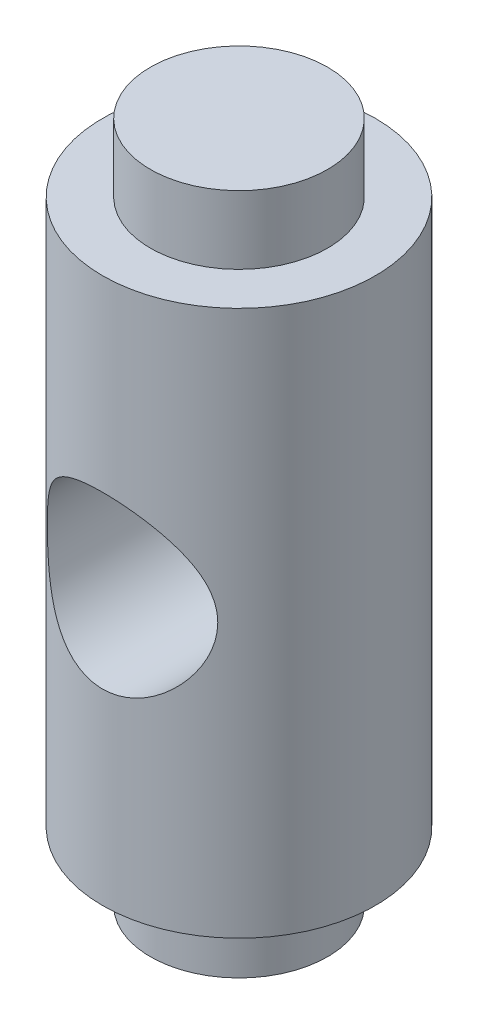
ISO-10303-21;
HEADER;
FILE_DESCRIPTION(('STEP AP214'),'2;1');
FILE_NAME('part.step','',(''),(''),'','','');
FILE_SCHEMA(('AUTOMOTIVE_DESIGN { 1 0 10303 214 1 1 1 1 }'));
ENDSEC;
DATA;
#1=APPLICATION_CONTEXT('core data for automotive mechanical design processes');
#2=APPLICATION_PROTOCOL_DEFINITION('international standard','automotive_design',2000,#1);
#3=PRODUCT_CONTEXT('',#1,'mechanical');
#4=PRODUCT('Part','Part','',(#3));
#5=PRODUCT_RELATED_PRODUCT_CATEGORY('part','',(#4));
#6=PRODUCT_DEFINITION_FORMATION('','',#4);
#7=PRODUCT_DEFINITION_CONTEXT('part definition',#1,'design');
#8=PRODUCT_DEFINITION('design','',#6,#7);
#9=PRODUCT_DEFINITION_SHAPE('','',#8);
#10=(LENGTH_UNIT() NAMED_UNIT(*) SI_UNIT(.MILLI.,.METRE.));
#11=(NAMED_UNIT(*) PLANE_ANGLE_UNIT() SI_UNIT($,.RADIAN.));
#12=(NAMED_UNIT(*) SI_UNIT($,.STERADIAN.) SOLID_ANGLE_UNIT());
#13=UNCERTAINTY_MEASURE_WITH_UNIT(LENGTH_MEASURE(1.E-05),#10,'distance_accuracy_value','');
#14=(GEOMETRIC_REPRESENTATION_CONTEXT(3) GLOBAL_UNCERTAINTY_ASSIGNED_CONTEXT((#13)) GLOBAL_UNIT_ASSIGNED_CONTEXT((#10,
#11,#12)) REPRESENTATION_CONTEXT('',''));
#15=CARTESIAN_POINT('',(0.,0.,0.));
#16=DIRECTION('',(0.,0.,1.));
#17=DIRECTION('',(1.,0.,0.));
#18=AXIS2_PLACEMENT_3D('',#15,#16,#17);
#19=CARTESIAN_POINT('',(-6.5,-25.,0.));
#20=DIRECTION('',(0.,1.,0.));
#21=DIRECTION('',(0.,0.,1.));
#22=AXIS2_PLACEMENT_3D('',#19,#20,#21);
#23=PLANE('',#22);
#24=CARTESIAN_POINT('',(0.,-25.,0.));
#25=DIRECTION('',(0.,-1.,0.));
#26=DIRECTION('',(0.,0.,-1.));
#27=AXIS2_PLACEMENT_3D('',#24,#25,#26);
#28=CIRCLE('',#27,6.5);
#29=CARTESIAN_POINT('',(0.,-25.,-6.5));
#30=VERTEX_POINT('',#29);
#31=EDGE_CURVE('E111',#30,#30,#28,.T.);
#32=ORIENTED_EDGE('',*,*,#31,.T.);
#33=EDGE_LOOP('',(#32));
#34=FACE_BOUND('',#33,.T.);
#35=ADVANCED_FACE('F53',(#34),#23,.F.);
#36=CARTESIAN_POINT('',(0.,25.,0.));
#37=DIRECTION('',(0.,-1.,0.));
#38=DIRECTION('',(0.,0.,-1.));
#39=AXIS2_PLACEMENT_3D('',#36,#37,#38);
#40=PLANE('',#39);
#41=CARTESIAN_POINT('',(0.,25.,0.));
#42=DIRECTION('',(0.,-1.,0.));
#43=DIRECTION('',(0.,0.,-1.));
#44=AXIS2_PLACEMENT_3D('',#41,#42,#43);
#45=CIRCLE('',#44,6.50000000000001);
#46=CARTESIAN_POINT('',(0.,25.,-6.50000000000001));
#47=VERTEX_POINT('',#46);
#48=EDGE_CURVE('E12',#47,#47,#45,.T.);
#49=ORIENTED_EDGE('',*,*,#48,.F.);
#50=EDGE_LOOP('',(#49));
#51=FACE_BOUND('',#50,.T.);
#52=ADVANCED_FACE('F102',(#51),#40,.F.);
#53=CARTESIAN_POINT('',(0.,-25.,0.));
#54=DIRECTION('',(0.,-1.,0.));
#55=DIRECTION('',(0.,0.,-1.));
#56=AXIS2_PLACEMENT_3D('',#53,#54,#55);
#57=CYLINDRICAL_SURFACE('',#56,6.50000000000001);
#58=CARTESIAN_POINT('',(0.,20.,0.));
#59=DIRECTION('',(0.,-1.,0.));
#60=DIRECTION('',(0.,0.,-1.));
#61=AXIS2_PLACEMENT_3D('',#58,#59,#60);
#62=CIRCLE('',#61,6.50000000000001);
#63=CARTESIAN_POINT('',(0.,20.,-6.50000000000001));
#64=VERTEX_POINT('',#63);
#65=EDGE_CURVE('E65',#64,#64,#62,.T.);
#66=ORIENTED_EDGE('',*,*,#65,.F.);
#67=EDGE_LOOP('',(#66));
#68=FACE_BOUND('',#67,.T.);
#69=ORIENTED_EDGE('',*,*,#48,.T.);
#70=EDGE_LOOP('',(#69));
#71=FACE_BOUND('',#70,.T.);
#72=ADVANCED_FACE('F107',(#68,#71),#57,.T.);
#73=CARTESIAN_POINT('',(-6.50000000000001,20.,0.));
#74=DIRECTION('',(0.,-1.,0.));
#75=DIRECTION('',(0.,0.,-1.));
#76=AXIS2_PLACEMENT_3D('',#73,#74,#75);
#77=PLANE('',#76);
#78=CARTESIAN_POINT('',(0.,20.,0.));
#79=DIRECTION('',(0.,-1.,0.));
#80=DIRECTION('',(0.,0.,-1.));
#81=AXIS2_PLACEMENT_3D('',#78,#79,#80);
#82=CIRCLE('',#81,10.);
#83=CARTESIAN_POINT('',(0.,20.,-10.));
#84=VERTEX_POINT('',#83);
#85=EDGE_CURVE('E70',#84,#84,#82,.T.);
#86=ORIENTED_EDGE('',*,*,#85,.F.);
#87=EDGE_LOOP('',(#86));
#88=FACE_BOUND('',#87,.T.);
#89=ORIENTED_EDGE('',*,*,#65,.T.);
#90=EDGE_LOOP('',(#89));
#91=FACE_BOUND('',#90,.T.);
#92=ADVANCED_FACE('F97',(#88,#91),#77,.F.);
#93=CARTESIAN_POINT('',(0.,-25.,0.));
#94=DIRECTION('',(0.,-1.,0.));
#95=DIRECTION('',(0.,0.,-1.));
#96=AXIS2_PLACEMENT_3D('',#93,#94,#95);
#97=CYLINDRICAL_SURFACE('',#96,10.);
#98=CARTESIAN_POINT('',(0.,6.24999999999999,-10.));
#99=CARTESIAN_POINT('',(-0.158849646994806,6.24999962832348,-9.99999962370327));
#100=CARTESIAN_POINT('',(-0.317707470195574,6.24393596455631,-9.99620658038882));
#101=CARTESIAN_POINT('',(-0.634207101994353,6.21976567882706,-9.98112704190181));
#102=CARTESIAN_POINT('',(-0.791848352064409,6.20165382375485,-9.96983729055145));
#103=CARTESIAN_POINT('',(-1.10484904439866,6.15360979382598,-9.94002305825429));
#104=CARTESIAN_POINT('',(-1.26020495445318,6.12366098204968,-9.92148839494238));
#105=CARTESIAN_POINT('',(-1.5673500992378,6.05233722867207,-9.87762604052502));
#106=CARTESIAN_POINT('',(-1.71913779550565,6.01095745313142,-9.8522954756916));
#107=CARTESIAN_POINT('',(-2.01729599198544,5.91754049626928,-9.79558133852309));
#108=CARTESIAN_POINT('',(-2.16369143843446,5.86556242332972,-9.76423139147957));
#109=CARTESIAN_POINT('',(-2.45114568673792,5.75137686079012,-9.69606866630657));
#110=CARTESIAN_POINT('',(-2.5922023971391,5.68916541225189,-9.6592537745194));
#111=CARTESIAN_POINT('',(-3.00613981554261,5.48812936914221,-9.54175890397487));
#112=CARTESIAN_POINT('',(-3.27012271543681,5.33479662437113,-9.45396244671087));
#113=CARTESIAN_POINT('',(-3.78991309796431,4.98055654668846,-9.25850339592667));
#114=CARTESIAN_POINT('',(-4.04338414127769,4.77682781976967,-9.14981422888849));
#115=CARTESIAN_POINT('',(-4.51494555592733,4.33387977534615,-8.92655135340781));
#116=CARTESIAN_POINT('',(-4.73298754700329,4.09461276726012,-8.81196987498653));
#117=CARTESIAN_POINT('',(-5.04439177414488,3.69463425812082,-8.63545017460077));
#118=CARTESIAN_POINT('',(-5.15093581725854,3.54461555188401,-8.57214497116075));
#119=CARTESIAN_POINT('',(-5.35092242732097,3.2348367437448,-8.44875316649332));
#120=CARTESIAN_POINT('',(-5.44436254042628,3.075074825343,-8.38866716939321));
#121=CARTESIAN_POINT('',(-5.70358441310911,2.58241975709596,-8.21657024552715));
#122=CARTESIAN_POINT('',(-5.84888618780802,2.23536799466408,-8.11235199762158));
#123=CARTESIAN_POINT('',(-6.04669029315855,1.60585511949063,-7.96547270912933));
#124=CARTESIAN_POINT('',(-6.11348568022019,1.3299784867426,-7.91385726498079));
#125=CARTESIAN_POINT('',(-6.18522365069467,0.908757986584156,-7.85772563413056));
#126=CARTESIAN_POINT('',(-6.20439258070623,0.767152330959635,-7.84256478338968));
#127=CARTESIAN_POINT('',(-6.23300288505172,0.482325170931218,-7.81984863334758));
#128=CARTESIAN_POINT('',(-6.24244412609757,0.339103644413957,-7.81229343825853));
#129=CARTESIAN_POINT('',(-6.25144296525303,0.0517742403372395,-7.80509383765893));
#130=CARTESIAN_POINT('',(-6.25097436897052,-0.092334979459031,-7.80547039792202));
#131=CARTESIAN_POINT('',(-6.2401009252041,-0.379934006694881,-7.81416589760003));
#132=CARTESIAN_POINT('',(-6.22969602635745,-0.523423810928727,-7.82248487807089));
#133=CARTESIAN_POINT('',(-6.19911092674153,-0.808776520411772,-7.84674476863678));
#134=CARTESIAN_POINT('',(-6.17892587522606,-0.950638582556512,-7.86268946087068));
#135=CARTESIAN_POINT('',(-6.12909005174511,-1.2317325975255,-7.90159751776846));
#136=CARTESIAN_POINT('',(-6.0994353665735,-1.37096343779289,-7.92456378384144));
#137=CARTESIAN_POINT('',(-5.99842622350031,-1.77702636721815,-8.00162469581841));
#138=CARTESIAN_POINT('',(-5.91425257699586,-2.03912297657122,-8.06453672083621));
#139=CARTESIAN_POINT('',(-5.71450774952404,-2.54584522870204,-8.20727735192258));
#140=CARTESIAN_POINT('',(-5.59892546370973,-2.79046465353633,-8.28711193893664));
#141=CARTESIAN_POINT('',(-5.31472790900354,-3.304176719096,-8.47275009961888));
#142=CARTESIAN_POINT('',(-5.14023916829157,-3.56930469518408,-8.58061888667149));
#143=CARTESIAN_POINT('',(-4.85091898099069,-3.94411817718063,-8.74534116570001));
#144=CARTESIAN_POINT('',(-4.7497903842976,-4.06532948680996,-8.80077999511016));
#145=CARTESIAN_POINT('',(-4.53858166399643,-4.29984502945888,-8.91153619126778));
#146=CARTESIAN_POINT('',(-4.42849989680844,-4.41314780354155,-8.96685353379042));
#147=CARTESIAN_POINT('',(-4.1808127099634,-4.64943582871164,-9.08529805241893));
#148=CARTESIAN_POINT('',(-4.04166674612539,-4.77092184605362,-9.14820324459));
#149=CARTESIAN_POINT('',(-3.75230201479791,-5.00169555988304,-9.27064717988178));
#150=CARTESIAN_POINT('',(-3.60208734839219,-5.11098773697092,-9.3301871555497));
#151=CARTESIAN_POINT('',(-3.2911853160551,-5.31651397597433,-9.44433792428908));
#152=CARTESIAN_POINT('',(-3.13049780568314,-5.41274785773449,-9.49894864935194));
#153=CARTESIAN_POINT('',(-2.79950918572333,-5.59111587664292,-9.60170623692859));
#154=CARTESIAN_POINT('',(-2.62920921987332,-5.67325168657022,-9.64985386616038));
#155=CARTESIAN_POINT('',(-2.28952714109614,-5.81831642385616,-9.73586579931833));
#156=CARTESIAN_POINT('',(-2.12059117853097,-5.88204249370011,-9.77414474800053));
#157=CARTESIAN_POINT('',(-1.77631615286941,-5.99499894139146,-9.84253471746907));
#158=CARTESIAN_POINT('',(-1.60097720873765,-6.04422958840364,-9.87264588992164));
#159=CARTESIAN_POINT('',(-1.24560560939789,-6.12733425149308,-9.92374181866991));
#160=CARTESIAN_POINT('',(-1.06557873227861,-6.16122630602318,-9.94473729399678));
#161=CARTESIAN_POINT('',(-0.702394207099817,-6.21311293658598,-9.97696623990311));
#162=CARTESIAN_POINT('',(-0.519237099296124,-6.23111022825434,-9.98820137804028));
#163=CARTESIAN_POINT('',(-0.179048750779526,-6.24940014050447,-9.99962329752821));
#164=CARTESIAN_POINT('',(-0.022179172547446,-6.25192604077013,-10.0012036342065));
#165=CARTESIAN_POINT('',(0.291205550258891,-6.24517861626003,-9.99698690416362));
#166=CARTESIAN_POINT('',(0.447720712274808,-6.23590588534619,-9.99119020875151));
#167=CARTESIAN_POINT('',(0.75915979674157,-6.2056952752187,-9.97236256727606));
#168=CARTESIAN_POINT('',(0.914083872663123,-6.18475853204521,-9.95933232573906));
#169=CARTESIAN_POINT('',(1.22121210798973,-6.13151164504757,-9.92635375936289));
#170=CARTESIAN_POINT('',(1.37341621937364,-6.09920130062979,-9.906405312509));
#171=CARTESIAN_POINT('',(1.66813711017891,-6.02511273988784,-9.86096653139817));
#172=CARTESIAN_POINT('',(1.81079921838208,-5.98375811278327,-9.835725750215));
#173=CARTESIAN_POINT('',(2.09188090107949,-5.89138769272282,-9.77980605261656));
#174=CARTESIAN_POINT('',(2.23029910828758,-5.84036882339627,-9.7491254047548));
#175=CARTESIAN_POINT('',(2.63804910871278,-5.67356171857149,-9.64980584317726));
#176=CARTESIAN_POINT('',(2.90010027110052,-5.54396581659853,-9.57385340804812));
#177=CARTESIAN_POINT('',(3.42545821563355,-5.23741629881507,-9.39949765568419));
#178=CARTESIAN_POINT('',(3.68622176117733,-5.05700284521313,-9.2996020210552));
#179=CARTESIAN_POINT('',(4.1757262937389,-4.66100995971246,-9.09033470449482));
#180=CARTESIAN_POINT('',(4.40443117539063,-4.44539146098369,-8.98095255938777));
#181=CARTESIAN_POINT('',(4.73648810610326,-4.08171051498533,-8.80819673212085));
#182=CARTESIAN_POINT('',(4.85166707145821,-3.94411382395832,-8.74512043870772));
#183=CARTESIAN_POINT('',(5.07005690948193,-3.65913503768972,-8.62034509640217));
#184=CARTESIAN_POINT('',(5.17326566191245,-3.51175121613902,-8.55864629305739));
#185=CARTESIAN_POINT('',(5.46389678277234,-3.05582609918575,-8.37840046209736));
#186=CARTESIAN_POINT('',(5.6327187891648,-2.73307989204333,-8.2644890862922));
#187=CARTESIAN_POINT('',(5.88426784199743,-2.12644842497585,-8.08666353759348));
#188=CARTESIAN_POINT('',(5.97762402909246,-1.84859906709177,-8.0172742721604));
#189=CARTESIAN_POINT('',(6.08820969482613,-1.42054627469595,-7.9332084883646));
#190=CARTESIAN_POINT('',(6.12015992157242,-1.27601322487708,-7.90852594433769));
#191=CARTESIAN_POINT('',(6.17383335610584,-0.984015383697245,-7.86669922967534));
#192=CARTESIAN_POINT('',(6.19556096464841,-0.836551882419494,-7.849551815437));
#193=CARTESIAN_POINT('',(6.22854173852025,-0.538829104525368,-7.82340808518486));
#194=CARTESIAN_POINT('',(6.2397310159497,-0.388558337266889,-7.81446149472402));
#195=CARTESIAN_POINT('',(6.25120688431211,-0.0873306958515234,-7.80528467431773));
#196=CARTESIAN_POINT('',(6.25149352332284,0.0636261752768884,-7.80505440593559));
#197=CARTESIAN_POINT('',(6.24115662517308,0.364967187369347,-7.81332234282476));
#198=CARTESIAN_POINT('',(6.23052977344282,0.515351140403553,-7.82182319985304));
#199=CARTESIAN_POINT('',(6.19855546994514,0.814250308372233,-7.84718570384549));
#200=CARTESIAN_POINT('',(6.17720816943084,0.96276554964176,-7.86404723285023));
#201=CARTESIAN_POINT('',(6.12629668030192,1.24492872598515,-7.90376101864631));
#202=CARTESIAN_POINT('',(6.09753696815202,1.3788074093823,-7.92601825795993));
#203=CARTESIAN_POINT('',(6.03161425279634,1.64339223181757,-7.97629888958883));
#204=CARTESIAN_POINT('',(5.99444845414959,1.77409729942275,-8.00432419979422));
#205=CARTESIAN_POINT('',(5.87091068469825,2.1605506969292,-8.09585891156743));
#206=CARTESIAN_POINT('',(5.77247378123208,2.41077058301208,-8.16684719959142));
#207=CARTESIAN_POINT('',(5.53013092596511,2.92801764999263,-8.33319831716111));
#208=CARTESIAN_POINT('',(5.3817054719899,3.19223374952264,-8.43060205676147));
#209=CARTESIAN_POINT('',(5.04997758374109,3.69470959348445,-8.63339479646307));
#210=CARTESIAN_POINT('',(4.86664695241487,3.93294810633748,-8.73879021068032));
#211=CARTESIAN_POINT('',(4.54776743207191,4.29099246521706,-8.90708368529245));
#212=CARTESIAN_POINT('',(4.42247185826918,4.420029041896,-8.97010341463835));
#213=CARTESIAN_POINT('',(4.1607895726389,4.66719403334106,-9.09443707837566));
#214=CARTESIAN_POINT('',(4.02440616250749,4.78532567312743,-9.15575151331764));
#215=CARTESIAN_POINT('',(3.74093187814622,5.01005717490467,-9.27518783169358));
#216=CARTESIAN_POINT('',(3.5938322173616,5.11664739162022,-9.33330702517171));
#217=CARTESIAN_POINT('',(3.28961408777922,5.31734354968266,-9.44482299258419));
#218=CARTESIAN_POINT('',(3.13249462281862,5.41144824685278,-9.49821929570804));
#219=CARTESIAN_POINT('',(2.80869746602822,5.58638047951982,-9.59895946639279));
#220=CARTESIAN_POINT('',(2.64200029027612,5.66717955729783,-9.64629031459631));
#221=CARTESIAN_POINT('',(2.30048838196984,5.81418820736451,-9.73338475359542));
#222=CARTESIAN_POINT('',(2.12567840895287,5.88040620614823,-9.77315271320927));
#223=CARTESIAN_POINT('',(1.76968730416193,5.99714094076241,-9.84383294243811));
#224=CARTESIAN_POINT('',(1.58852482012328,6.04769994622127,-9.8747690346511));
#225=CARTESIAN_POINT('',(1.22114051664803,6.13243883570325,-9.92689202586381));
#226=CARTESIAN_POINT('',(1.03492253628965,6.16663080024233,-9.94808611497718));
#227=CARTESIAN_POINT('',(0.707135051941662,6.21147686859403,-9.97595756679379));
#228=CARTESIAN_POINT('',(0.566265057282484,6.22590687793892,-9.98495677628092));
#229=CARTESIAN_POINT('',(0.283598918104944,6.24516890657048,-9.99697834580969));
#230=CARTESIAN_POINT('',(0.14180271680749,6.25000033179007,-10.0000003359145));
#231=CARTESIAN_POINT('',(0.,6.24999999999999,-10.));
#232=B_SPLINE_CURVE_WITH_KNOTS('',3,(#98,#99,#100,#101,#102,#103,#104,#105,#106,#107,#108,#109,
#110,#111,#112,#113,#114,#115,#116,#117,#118,#119,#120,#121,#122,#123,#124,#125,#126,#127,#128,
#129,#130,#131,#132,#133,#134,#135,#136,#137,#138,#139,#140,#141,#142,#143,#144,#145,#146,#147,
#148,#149,#150,#151,#152,#153,#154,#155,#156,#157,#158,#159,#160,#161,#162,#163,#164,#165,#166,
#167,#168,#169,#170,#171,#172,#173,#174,#175,#176,#177,#178,#179,#180,#181,#182,#183,#184,#185,
#186,#187,#188,#189,#190,#191,#192,#193,#194,#195,#196,#197,#198,#199,#200,#201,#202,#203,#204,
#205,#206,#207,#208,#209,#210,#211,#212,#213,#214,#215,#216,#217,#218,#219,#220,#221,#222,#223,
#224,#225,#226,#227,#228,#229,#230,#231),.UNSPECIFIED.,.T.,.F.,(4,2,2,2,2,2,2,2,2,2,2,2,2,2,2,2,
2,2,2,2,2,2,2,2,2,2,2,2,2,2,2,2,2,2,2,2,2,2,2,2,2,2,2,2,2,2,2,2,2,2,2,2,2,2,2,2,2,2,2,2,2,2,2,2,
2,2,4),(0.,0.476403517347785,0.953014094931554,1.43029694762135,1.90778194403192,
2.3826733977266,2.85774900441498,3.80683933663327,4.8317234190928,5.85799548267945,
6.44111179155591,7.02433714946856,8.18762458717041,9.04928880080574,9.47991092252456,
9.91053894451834,10.3423053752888,10.7740740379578,11.2060570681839,11.6382188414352,
12.4818815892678,13.3258430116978,14.3274621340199,14.8290636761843,15.3307575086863,
15.9154508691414,16.4999286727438,17.0844145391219,17.6688310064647,18.2217184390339,
18.7745956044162,19.3268208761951,19.8789517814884,20.3490458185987,20.8191161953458,
21.2891407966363,21.7591736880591,22.210671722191,22.6623137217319,23.5649034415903,
24.5586000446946,25.5534069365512,26.1234425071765,26.6935788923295,27.8320048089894,
28.7317904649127,29.1814976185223,29.6310109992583,30.083232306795,30.535451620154,
30.9878083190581,31.4401586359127,31.8559131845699,32.2718061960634,33.1031851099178,
34.0549238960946,35.0074348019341,35.5786225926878,36.1496409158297,36.7211328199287,
37.2926816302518,37.8654374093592,38.4378613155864,39.0087262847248,39.5791692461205,
40.0044212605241,40.4296995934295),.UNSPECIFIED.);
#233=CARTESIAN_POINT('',(0.,6.24999999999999,-10.));
#234=VERTEX_POINT('',#233);
#235=EDGE_CURVE('E56',#234,#234,#232,.T.);
#236=ORIENTED_EDGE('',*,*,#235,.T.);
#237=EDGE_LOOP('',(#236));
#238=FACE_BOUND('',#237,.T.);
#239=CARTESIAN_POINT('',(6.24999999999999,0.,7.80624749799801));
#240=CARTESIAN_POINT('',(6.249998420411,-0.155387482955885,7.80624999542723));
#241=CARTESIAN_POINT('',(6.24419345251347,-0.31080490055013,7.81090743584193));
#242=CARTESIAN_POINT('',(6.22107983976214,-0.620302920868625,7.82932791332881));
#243=CARTESIAN_POINT('',(6.20376441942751,-0.774382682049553,7.84309631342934));
#244=CARTESIAN_POINT('',(6.15789601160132,-1.08016617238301,7.87916024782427));
#245=CARTESIAN_POINT('',(6.12932035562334,-1.23186446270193,7.90147298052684));
#246=CARTESIAN_POINT('',(6.06140113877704,-1.53152285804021,7.95369366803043));
#247=CARTESIAN_POINT('',(6.02205219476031,-1.67948105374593,7.98360541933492));
#248=CARTESIAN_POINT('',(5.88944383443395,-2.11373015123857,8.08248455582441));
#249=CARTESIAN_POINT('',(5.78115473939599,-2.39341060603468,8.16098921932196));
#250=CARTESIAN_POINT('',(5.52859220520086,-2.93008674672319,8.33415018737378));
#251=CARTESIAN_POINT('',(5.3843177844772,-3.18708181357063,8.42880693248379));
#252=CARTESIAN_POINT('',(5.04117438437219,-3.70933905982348,8.63899089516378));
#253=CARTESIAN_POINT('',(4.83757785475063,-3.97108500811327,8.75561439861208));
#254=CARTESIAN_POINT('',(4.50310779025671,-4.33727102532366,8.92960975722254));
#255=CARTESIAN_POINT('',(4.38667459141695,-4.45500513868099,8.9874941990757));
#256=CARTESIAN_POINT('',(4.14437550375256,-4.68125143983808,9.1017618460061));
#257=CARTESIAN_POINT('',(4.01850779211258,-4.78976183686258,9.1581447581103));
#258=CARTESIAN_POINT('',(3.74198038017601,-5.0094846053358,9.27484517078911));
#259=CARTESIAN_POINT('',(3.59016440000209,-5.11943222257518,9.33481202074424));
#260=CARTESIAN_POINT('',(3.27596963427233,-5.32595927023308,9.44965505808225));
#261=CARTESIAN_POINT('',(3.11359567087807,-5.42254474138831,9.50453354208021));
#262=CARTESIAN_POINT('',(2.77917438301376,-5.60130490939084,9.6076421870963));
#263=CARTESIAN_POINT('',(2.60713168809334,-5.68348642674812,9.65587549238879));
#264=CARTESIAN_POINT('',(2.25447682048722,-5.83236190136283,9.74424725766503));
#265=CARTESIAN_POINT('',(2.07386621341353,-5.89905867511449,9.78438718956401));
#266=CARTESIAN_POINT('',(1.72429670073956,-6.00994391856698,9.85165924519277));
#267=CARTESIAN_POINT('',(1.55601899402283,-6.05573098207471,9.87969874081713));
#268=CARTESIAN_POINT('',(1.21508140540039,-6.13323954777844,9.92739601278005));
#269=CARTESIAN_POINT('',(1.04242179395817,-6.16496191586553,9.94705430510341));
#270=CARTESIAN_POINT('',(0.694418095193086,-6.21378548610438,9.97738765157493));
#271=CARTESIAN_POINT('',(0.519076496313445,-6.23089949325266,9.98807057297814));
#272=CARTESIAN_POINT('',(0.167262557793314,-6.25024383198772,10.0001494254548));
#273=CARTESIAN_POINT('',(-0.0092096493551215,-6.25247587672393,10.0015464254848));
#274=CARTESIAN_POINT('',(-0.337797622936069,-6.24272897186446,9.99545690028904));
#275=CARTESIAN_POINT('',(-0.489995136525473,-6.2326220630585,9.98914058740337));
#276=CARTESIAN_POINT('',(-0.792864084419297,-6.20137456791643,9.96967381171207));
#277=CARTESIAN_POINT('',(-0.943535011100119,-6.18023042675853,9.95652114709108));
#278=CARTESIAN_POINT('',(-1.24218605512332,-6.12719105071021,9.92368567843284));
#279=CARTESIAN_POINT('',(-1.39016709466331,-6.09529957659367,9.9040051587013));
#280=CARTESIAN_POINT('',(-1.68259878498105,-6.02114007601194,9.85853794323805));
#281=CARTESIAN_POINT('',(-1.82704804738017,-5.97886803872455,9.8327488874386));
#282=CARTESIAN_POINT('',(-2.11183488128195,-5.88431877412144,9.77554531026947));
#283=CARTESIAN_POINT('',(-2.25216317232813,-5.83202070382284,9.74411907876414));
#284=CARTESIAN_POINT('',(-2.52771418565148,-5.71799109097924,9.67630245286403));
#285=CARTESIAN_POINT('',(-2.66293507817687,-5.6562562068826,9.63991030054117));
#286=CARTESIAN_POINT('',(-3.05995814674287,-5.45771071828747,9.52430903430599));
#287=CARTESIAN_POINT('',(-3.31332080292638,-5.30749199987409,9.43863344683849));
#288=CARTESIAN_POINT('',(-3.82360467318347,-4.95484984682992,9.24465724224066));
#289=CARTESIAN_POINT('',(-4.0770449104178,-4.7482561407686,9.13486787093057));
#290=CARTESIAN_POINT('',(-4.5480098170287,-4.29930878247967,8.90975545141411));
#291=CARTESIAN_POINT('',(-4.76548130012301,-4.05690316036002,8.79442452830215));
#292=CARTESIAN_POINT('',(-5.07500078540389,-3.65249695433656,8.61748442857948));
#293=CARTESIAN_POINT('',(-5.18050584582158,-3.50128924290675,8.55429402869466));
#294=CARTESIAN_POINT('',(-5.37833747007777,-3.18906409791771,8.43131246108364));
#295=CARTESIAN_POINT('',(-5.47066155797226,-3.02804482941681,8.37152193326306));
#296=CARTESIAN_POINT('',(-5.64116538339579,-2.69710163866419,8.25758814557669));
#297=CARTESIAN_POINT('',(-5.71936611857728,-2.52719142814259,8.2034365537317));
#298=CARTESIAN_POINT('',(-5.86084129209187,-2.17905934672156,8.10296698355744));
#299=CARTESIAN_POINT('',(-5.92412210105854,-2.00084106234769,8.05664566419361));
#300=CARTESIAN_POINT('',(-6.02017773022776,-1.68510420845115,7.98498866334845));
#301=CARTESIAN_POINT('',(-6.05659845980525,-1.54921061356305,7.95733787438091));
#302=CARTESIAN_POINT('',(-6.12036221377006,-1.27419668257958,7.908399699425));
#303=CARTESIAN_POINT('',(-6.14770743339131,-1.13507713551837,7.88711077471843));
#304=CARTESIAN_POINT('',(-6.19292945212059,-0.854566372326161,7.85165287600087));
#305=CARTESIAN_POINT('',(-6.21081692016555,-0.713177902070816,7.83747588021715));
#306=CARTESIAN_POINT('',(-6.23689599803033,-0.42894429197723,7.81673898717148));
#307=CARTESIAN_POINT('',(-6.24508745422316,-0.286099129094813,7.81017921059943));
#308=CARTESIAN_POINT('',(-6.25164471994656,0.000293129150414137,7.80493157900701));
#309=CARTESIAN_POINT('',(-6.24998784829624,0.143841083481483,7.8062618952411));
#310=CARTESIAN_POINT('',(-6.23682473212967,0.430189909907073,7.81678235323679));
#311=CARTESIAN_POINT('',(-6.22531843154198,0.572990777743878,7.82597253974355));
#312=CARTESIAN_POINT('',(-6.19263271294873,0.856865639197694,7.8518617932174));
#313=CARTESIAN_POINT('',(-6.17144828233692,0.997938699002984,7.86856475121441));
#314=CARTESIAN_POINT('',(-6.11972444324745,1.27737953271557,7.90885813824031));
#315=CARTESIAN_POINT('',(-6.0891811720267,1.41574616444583,7.93245141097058));
#316=CARTESIAN_POINT('',(-5.98526939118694,1.82092780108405,8.011497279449));
#317=CARTESIAN_POINT('',(-5.89901607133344,2.08285458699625,8.07572442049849));
#318=CARTESIAN_POINT('',(-5.69512055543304,2.58897546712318,8.22077814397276));
#319=CARTESIAN_POINT('',(-5.5774672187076,2.83316322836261,8.3016106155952));
#320=CARTESIAN_POINT('',(-5.2882516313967,3.3465409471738,8.48936955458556));
#321=CARTESIAN_POINT('',(-5.11069041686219,3.61163977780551,8.59833402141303));
#322=CARTESIAN_POINT('',(-4.81656643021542,3.98603162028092,8.76432865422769));
#323=CARTESIAN_POINT('',(-4.71380166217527,4.10704004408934,8.82013037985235));
#324=CARTESIAN_POINT('',(-4.49925587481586,4.34101125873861,8.93147717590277));
#325=CARTESIAN_POINT('',(-4.38747319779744,4.45397256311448,8.98702219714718));
#326=CARTESIAN_POINT('',(-4.13658544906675,4.6888431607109,9.10554121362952));
#327=CARTESIAN_POINT('',(-3.99597671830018,4.80927221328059,9.16827423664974));
#328=CARTESIAN_POINT('',(-3.70371365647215,5.03779679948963,9.29018637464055));
#329=CARTESIAN_POINT('',(-3.55206351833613,5.14589697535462,9.34936682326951));
#330=CARTESIAN_POINT('',(-3.23834643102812,5.34887947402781,9.46260630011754));
#331=CARTESIAN_POINT('',(-3.07627999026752,5.44376244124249,9.51666557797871));
#332=CARTESIAN_POINT('',(-2.74261225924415,5.61926124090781,9.61813238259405));
#333=CARTESIAN_POINT('',(-2.5710121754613,5.6998788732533,9.6655407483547));
#334=CARTESIAN_POINT('',(-2.22991478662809,5.84140481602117,9.74969081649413));
#335=CARTESIAN_POINT('',(-2.06090217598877,5.90320169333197,9.78689997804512));
#336=CARTESIAN_POINT('',(-1.71668723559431,6.01232675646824,9.8531055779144));
#337=CARTESIAN_POINT('',(-1.54148505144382,6.05965528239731,9.88210220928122));
#338=CARTESIAN_POINT('',(-1.18660606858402,6.13901345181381,9.93096213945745));
#339=CARTESIAN_POINT('',(-1.00693466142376,6.1710606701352,9.95083592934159));
#340=CARTESIAN_POINT('',(-0.644684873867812,6.21934500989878,9.98085122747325));
#341=CARTESIAN_POINT('',(-0.46210697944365,6.23558474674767,9.99099434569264));
#342=CARTESIAN_POINT('',(-0.123040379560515,6.2507409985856,10.0004620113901));
#343=CARTESIAN_POINT('',(0.033316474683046,6.25186288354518,10.0011638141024));
#344=CARTESIAN_POINT('',(0.345535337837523,6.2423946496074,9.99524764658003));
#345=CARTESIAN_POINT('',(0.501397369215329,6.23180507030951,9.98863001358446));
#346=CARTESIAN_POINT('',(0.811409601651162,6.19906528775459,9.96823692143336));
#347=CARTESIAN_POINT('',(0.965559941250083,6.17691602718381,9.95446204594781));
#348=CARTESIAN_POINT('',(1.27104006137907,6.12136110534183,9.92008500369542));
#349=CARTESIAN_POINT('',(1.42236978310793,6.08795520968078,9.89948269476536));
#350=CARTESIAN_POINT('',(1.71596337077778,6.01166852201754,9.85275498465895));
#351=CARTESIAN_POINT('',(1.85835915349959,5.96916034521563,9.82684817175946));
#352=CARTESIAN_POINT('',(2.13881633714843,5.87451256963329,9.76964610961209));
#353=CARTESIAN_POINT('',(2.27687631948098,5.82236985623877,9.73834911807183));
#354=CARTESIAN_POINT('',(2.68343007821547,5.65224518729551,9.63727069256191));
#355=CARTESIAN_POINT('',(2.94452059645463,5.52050790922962,9.56026493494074));
#356=CARTESIAN_POINT('',(3.46832159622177,5.20918901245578,9.38376400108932));
#357=CARTESIAN_POINT('',(3.72838741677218,5.02606066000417,9.28276415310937));
#358=CARTESIAN_POINT('',(4.21609627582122,4.62459625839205,9.07166797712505));
#359=CARTESIAN_POINT('',(4.44370217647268,4.40622048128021,8.96156145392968));
#360=CARTESIAN_POINT('',(4.77359198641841,4.0382773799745,8.78813341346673));
#361=CARTESIAN_POINT('',(4.88785485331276,3.89920362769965,8.72493381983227));
#362=CARTESIAN_POINT('',(5.10428230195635,3.61126873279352,8.60011149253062));
#363=CARTESIAN_POINT('',(5.20644468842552,3.46240582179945,8.5384890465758));
#364=CARTESIAN_POINT('',(5.49374593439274,3.00199316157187,8.3588028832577));
#365=CARTESIAN_POINT('',(5.6600596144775,2.6762183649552,8.24572180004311));
#366=CARTESIAN_POINT('',(5.90498364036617,2.06787527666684,8.07147824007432));
#367=CARTESIAN_POINT('',(5.99483761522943,1.79155857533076,8.00436702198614));
#368=CARTESIAN_POINT('',(6.10051812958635,1.36655765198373,7.92373547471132));
#369=CARTESIAN_POINT('',(6.13087893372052,1.22328572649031,7.90021112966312));
#370=CARTESIAN_POINT('',(6.18156014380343,0.93399126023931,7.86062146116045));
#371=CARTESIAN_POINT('',(6.20188571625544,0.787970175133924,7.8445522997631));
#372=CARTESIAN_POINT('',(6.22798782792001,0.534868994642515,7.8238324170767));
#373=CARTESIAN_POINT('',(6.23623373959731,0.428191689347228,7.81725263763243));
#374=CARTESIAN_POINT('',(6.24724106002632,0.214347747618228,7.80845876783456));
#375=CARTESIAN_POINT('',(6.25000108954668,0.107180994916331,7.80624577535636));
#376=CARTESIAN_POINT('',(6.24999999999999,0.,7.80624749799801));
#377=B_SPLINE_CURVE_WITH_KNOTS('',3,(#239,#240,#241,#242,#243,#244,#245,#246,#247,#248,#249,
#250,#251,#252,#253,#254,#255,#256,#257,#258,#259,#260,#261,#262,#263,#264,#265,#266,#267,#268,
#269,#270,#271,#272,#273,#274,#275,#276,#277,#278,#279,#280,#281,#282,#283,#284,#285,#286,#287,
#288,#289,#290,#291,#292,#293,#294,#295,#296,#297,#298,#299,#300,#301,#302,#303,#304,#305,#306,
#307,#308,#309,#310,#311,#312,#313,#314,#315,#316,#317,#318,#319,#320,#321,#322,#323,#324,#325,
#326,#327,#328,#329,#330,#331,#332,#333,#334,#335,#336,#337,#338,#339,#340,#341,#342,#343,#344,
#345,#346,#347,#348,#349,#350,#351,#352,#353,#354,#355,#356,#357,#358,#359,#360,#361,#362,#363,
#364,#365,#366,#367,#368,#369,#370,#371,#372,#373,#374,#375,#376),.UNSPECIFIED.,.T.,.F.,(4,2,2,
2,2,2,2,2,2,2,2,2,2,2,2,2,2,2,2,2,2,2,2,2,2,2,2,2,2,2,2,2,2,2,2,2,2,2,2,2,2,2,2,2,2,2,2,2,2,2,2,
2,2,2,2,2,2,2,2,2,2,2,2,2,2,2,2,2,4),(0.,0.466038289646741,0.932351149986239,1.39960760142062,
1.86709795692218,2.79296746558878,3.71886223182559,4.76897072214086,5.29480658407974,
5.82074430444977,6.41038725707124,6.99976276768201,7.58885844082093,8.17784688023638,
8.70697886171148,9.23607826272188,9.76471340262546,10.293287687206,10.7507283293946,
11.2083163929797,11.6657445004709,12.123349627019,12.5819165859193,13.0406462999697,
13.9574668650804,14.9883828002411,16.0208097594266,16.6049244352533,17.1891486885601,
17.77249707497,18.3555959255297,18.785319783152,19.2149396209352,19.6440737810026,
20.0732147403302,20.5033444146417,20.933476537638,21.3638316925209,21.7943647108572,
22.6403323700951,23.4866005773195,24.4939884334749,24.9984877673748,25.5030800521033,
26.0887790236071,26.6742567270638,27.2597058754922,27.845081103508,28.3955530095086,
28.9460119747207,29.4958363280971,30.045569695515,30.5140633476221,30.9825354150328,
31.4509692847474,31.9194129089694,32.3714581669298,32.8236498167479,33.7273401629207,
34.724828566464,35.7234492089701,36.2951625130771,36.866979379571,38.0089089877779,
38.8997336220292,39.3442527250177,39.7885427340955,40.10991928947,40.4313766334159),.UNSPECIFIED.);
#378=CARTESIAN_POINT('',(6.24999999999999,0.,7.80624749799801));
#379=VERTEX_POINT('',#378);
#380=EDGE_CURVE('E73',#379,#379,#377,.T.);
#381=ORIENTED_EDGE('',*,*,#380,.T.);
#382=EDGE_LOOP('',(#381));
#383=FACE_BOUND('',#382,.T.);
#384=CARTESIAN_POINT('',(0.,-20.,0.));
#385=DIRECTION('',(0.,-1.,0.));
#386=DIRECTION('',(0.,0.,-1.));
#387=AXIS2_PLACEMENT_3D('',#384,#385,#386);
#388=CIRCLE('',#387,10.);
#389=CARTESIAN_POINT('',(0.,-20.,-10.));
#390=VERTEX_POINT('',#389);
#391=EDGE_CURVE('E115',#390,#390,#388,.T.);
#392=ORIENTED_EDGE('',*,*,#391,.F.);
#393=EDGE_LOOP('',(#392));
#394=FACE_BOUND('',#393,.T.);
#395=ORIENTED_EDGE('',*,*,#85,.T.);
#396=EDGE_LOOP('',(#395));
#397=FACE_BOUND('',#396,.T.);
#398=ADVANCED_FACE('F78',(#238,#383,#394,#397),#97,.T.);
#399=CARTESIAN_POINT('',(-10.,-20.,0.));
#400=DIRECTION('',(0.,1.,0.));
#401=DIRECTION('',(0.,0.,1.));
#402=AXIS2_PLACEMENT_3D('',#399,#400,#401);
#403=PLANE('',#402);
#404=CARTESIAN_POINT('',(0.,-20.,0.));
#405=DIRECTION('',(0.,-1.,0.));
#406=DIRECTION('',(0.,0.,-1.));
#407=AXIS2_PLACEMENT_3D('',#404,#405,#406);
#408=CIRCLE('',#407,6.5);
#409=CARTESIAN_POINT('',(0.,-20.,-6.5));
#410=VERTEX_POINT('',#409);
#411=EDGE_CURVE('E112',#410,#410,#408,.T.);
#412=ORIENTED_EDGE('',*,*,#411,.F.);
#413=EDGE_LOOP('',(#412));
#414=FACE_BOUND('',#413,.T.);
#415=ORIENTED_EDGE('',*,*,#391,.T.);
#416=EDGE_LOOP('',(#415));
#417=FACE_BOUND('',#416,.T.);
#418=ADVANCED_FACE('F90',(#414,#417),#403,.F.);
#419=CARTESIAN_POINT('',(0.,-25.,0.));
#420=DIRECTION('',(0.,-1.,0.));
#421=DIRECTION('',(0.,0.,-1.));
#422=AXIS2_PLACEMENT_3D('',#419,#420,#421);
#423=CYLINDRICAL_SURFACE('',#422,6.5);
#424=ORIENTED_EDGE('',*,*,#31,.F.);
#425=EDGE_LOOP('',(#424));
#426=FACE_BOUND('',#425,.T.);
#427=ORIENTED_EDGE('',*,*,#411,.T.);
#428=EDGE_LOOP('',(#427));
#429=FACE_BOUND('',#428,.T.);
#430=ADVANCED_FACE('F86',(#426,#429),#423,.T.);
#431=CARTESIAN_POINT('',(0.,0.,12.));
#432=DIRECTION('',(0.,0.,1.));
#433=DIRECTION('',(1.,0.,0.));
#434=AXIS2_PLACEMENT_3D('',#431,#432,#433);
#435=CYLINDRICAL_SURFACE('',#434,6.24999999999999);
#436=ORIENTED_EDGE('',*,*,#380,.F.);
#437=EDGE_LOOP('',(#436));
#438=FACE_BOUND('',#437,.T.);
#439=ORIENTED_EDGE('',*,*,#235,.F.);
#440=EDGE_LOOP('',(#439));
#441=FACE_BOUND('',#440,.T.);
#442=ADVANCED_FACE('F82',(#438,#441),#435,.F.);
#443=CLOSED_SHELL('',(#35,#52,#72,#92,#398,#418,#430,#442));
#444=MANIFOLD_SOLID_BREP('B2',#443);
#445=ADVANCED_BREP_SHAPE_REPRESENTATION('',(#18,#444),#14);
#446=SHAPE_DEFINITION_REPRESENTATION(#9,#445);
ENDSEC;
END-ISO-10303-21;
